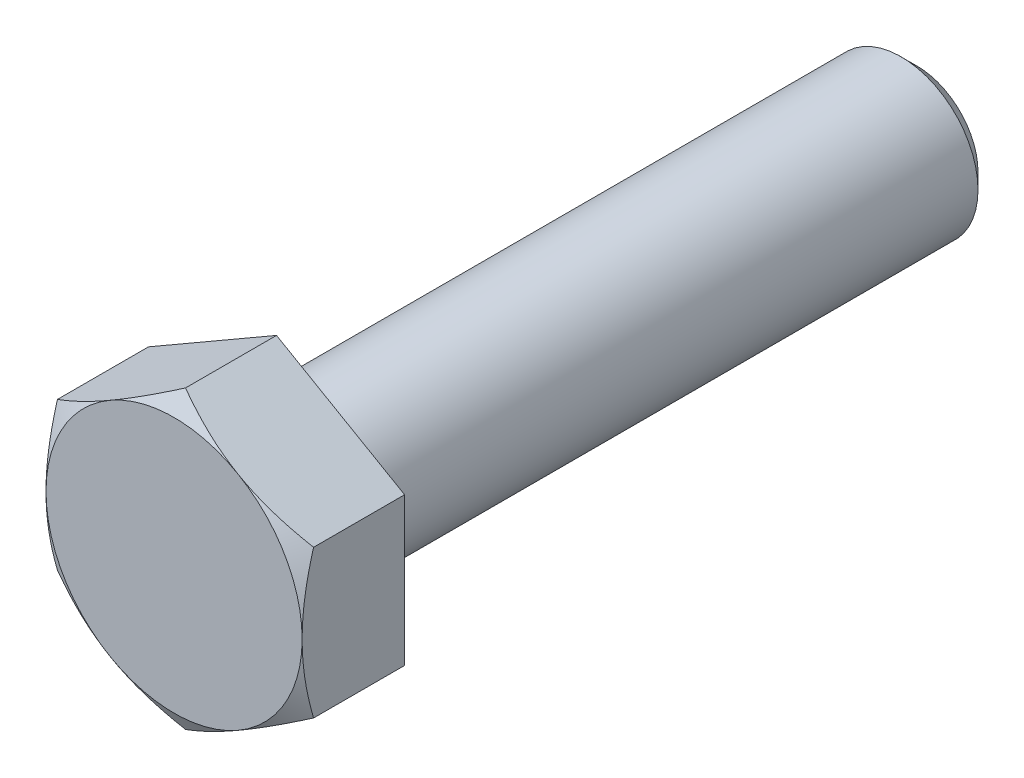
ISO-10303-21;
HEADER;
FILE_DESCRIPTION(('STEP AP214'),'2;1');
FILE_NAME('part.step','',(''),(''),'','','');
FILE_SCHEMA(('AUTOMOTIVE_DESIGN { 1 0 10303 214 1 1 1 1 }'));
ENDSEC;
DATA;
#1=APPLICATION_CONTEXT('core data for automotive mechanical design processes');
#2=APPLICATION_PROTOCOL_DEFINITION('international standard','automotive_design',2000,#1);
#3=PRODUCT_CONTEXT('',#1,'mechanical');
#4=PRODUCT('Part','Part','',(#3));
#5=PRODUCT_RELATED_PRODUCT_CATEGORY('part','',(#4));
#6=PRODUCT_DEFINITION_FORMATION('','',#4);
#7=PRODUCT_DEFINITION_CONTEXT('part definition',#1,'design');
#8=PRODUCT_DEFINITION('design','',#6,#7);
#9=PRODUCT_DEFINITION_SHAPE('','',#8);
#10=(LENGTH_UNIT() NAMED_UNIT(*) SI_UNIT(.MILLI.,.METRE.));
#11=(NAMED_UNIT(*) PLANE_ANGLE_UNIT() SI_UNIT($,.RADIAN.));
#12=(NAMED_UNIT(*) SI_UNIT($,.STERADIAN.) SOLID_ANGLE_UNIT());
#13=UNCERTAINTY_MEASURE_WITH_UNIT(LENGTH_MEASURE(1.E-05),#10,'distance_accuracy_value','');
#14=(GEOMETRIC_REPRESENTATION_CONTEXT(3) GLOBAL_UNCERTAINTY_ASSIGNED_CONTEXT((#13)) GLOBAL_UNIT_ASSIGNED_CONTEXT((#10,
#11,#12)) REPRESENTATION_CONTEXT('',''));
#15=CARTESIAN_POINT('',(0.,0.,0.));
#16=DIRECTION('',(0.,0.,1.));
#17=DIRECTION('',(1.,0.,0.));
#18=AXIS2_PLACEMENT_3D('',#15,#16,#17);
#19=CARTESIAN_POINT('',(25.5,22.5,-25.4));
#20=DIRECTION('',(0.,0.,-1.));
#21=DIRECTION('',(-1.,0.,0.));
#22=AXIS2_PLACEMENT_3D('',#19,#20,#21);
#23=PLANE('',#22);
#24=CARTESIAN_POINT('',(25.5,22.5,-25.4000000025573));
#25=DIRECTION('',(0.,0.,-1.));
#26=DIRECTION('',(0.,1.,0.));
#27=AXIS2_PLACEMENT_3D('',#24,#25,#26);
#28=CIRCLE('',#27,4.99999999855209);
#29=CARTESIAN_POINT('',(23.000000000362,18.1698729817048,-25.4000000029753));
#30=VERTEX_POINT('',#29);
#31=CARTESIAN_POINT('',(20.500000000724,22.5,-25.4000000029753));
#32=VERTEX_POINT('',#31);
#33=EDGE_CURVE('E19',#30,#32,#28,.T.);
#34=ORIENTED_EDGE('',*,*,#33,.F.);
#35=CARTESIAN_POINT('',(25.5,22.5,-25.4000000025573));
#36=DIRECTION('',(0.,0.,-1.));
#37=DIRECTION('',(0.,1.,0.));
#38=AXIS2_PLACEMENT_3D('',#35,#36,#37);
#39=CIRCLE('',#38,4.99999999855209);
#40=CARTESIAN_POINT('',(27.999999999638,18.1698729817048,-25.4000000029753));
#41=VERTEX_POINT('',#40);
#42=EDGE_CURVE('E77',#41,#30,#39,.T.);
#43=ORIENTED_EDGE('',*,*,#42,.F.);
#44=CARTESIAN_POINT('',(25.5,22.5,-25.4000000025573));
#45=DIRECTION('',(0.,0.,-1.));
#46=DIRECTION('',(0.,1.,0.));
#47=AXIS2_PLACEMENT_3D('',#44,#45,#46);
#48=CIRCLE('',#47,4.99999999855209);
#49=CARTESIAN_POINT('',(30.499999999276,22.5,-25.4000000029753));
#50=VERTEX_POINT('',#49);
#51=EDGE_CURVE('E94',#50,#41,#48,.T.);
#52=ORIENTED_EDGE('',*,*,#51,.F.);
#53=CARTESIAN_POINT('',(25.5,22.5,-25.4000000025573));
#54=DIRECTION('',(0.,0.,-1.));
#55=DIRECTION('',(0.,1.,0.));
#56=AXIS2_PLACEMENT_3D('',#53,#54,#55);
#57=CIRCLE('',#56,4.99999999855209);
#58=CARTESIAN_POINT('',(27.999999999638,26.8301270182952,-25.4000000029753));
#59=VERTEX_POINT('',#58);
#60=EDGE_CURVE('E460',#59,#50,#57,.T.);
#61=ORIENTED_EDGE('',*,*,#60,.F.);
#62=CARTESIAN_POINT('',(25.5,22.5,-25.4000000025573));
#63=DIRECTION('',(0.,0.,-1.));
#64=DIRECTION('',(0.,1.,0.));
#65=AXIS2_PLACEMENT_3D('',#62,#63,#64);
#66=CIRCLE('',#65,4.99999999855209);
#67=CARTESIAN_POINT('',(23.000000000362,26.8301270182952,-25.4000000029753));
#68=VERTEX_POINT('',#67);
#69=EDGE_CURVE('E457',#68,#59,#66,.T.);
#70=ORIENTED_EDGE('',*,*,#69,.F.);
#71=CARTESIAN_POINT('',(25.5,22.5,-25.4000000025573));
#72=DIRECTION('',(0.,0.,-1.));
#73=DIRECTION('',(0.,1.,0.));
#74=AXIS2_PLACEMENT_3D('',#71,#72,#73);
#75=CIRCLE('',#74,4.99999999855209);
#76=EDGE_CURVE('E80',#32,#68,#75,.T.);
#77=ORIENTED_EDGE('',*,*,#76,.F.);
#78=EDGE_LOOP('',(#34,#43,#52,#61,#70,#77));
#79=FACE_BOUND('',#78,.T.);
#80=ADVANCED_FACE('F16',(#79),#23,.F.);
#81=CARTESIAN_POINT('',(25.5,22.5,-25.8492614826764));
#82=DIRECTION('',(0.,0.,-1.));
#83=DIRECTION('',(0.,1.,0.));
#84=AXIS2_PLACEMENT_3D('',#81,#82,#83);
#85=CONICAL_SURFACE('',#84,5.7781437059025,1.04719755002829);
#86=ORIENTED_EDGE('',*,*,#33,.T.);
#87=CARTESIAN_POINT('',(20.4999999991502,19.6132486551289,-25.8465819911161));
#88=CARTESIAN_POINT('',(20.4999999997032,19.8482289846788,-25.7787319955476));
#89=CARTESIAN_POINT('',(20.4999999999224,20.085091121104,-25.7165695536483));
#90=CARTESIAN_POINT('',(20.5000000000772,20.5609033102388,-25.6069472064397));
#91=CARTESIAN_POINT('',(20.5000000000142,20.7998367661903,-25.5594146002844));
#92=CARTESIAN_POINT('',(20.4999999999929,21.16049190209,-25.501052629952));
#93=CARTESIAN_POINT('',(20.4999999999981,21.2811658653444,-25.4837477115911));
#94=CARTESIAN_POINT('',(20.5000000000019,21.5230915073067,-25.4537925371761));
#95=CARTESIAN_POINT('',(20.5000000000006,21.6443431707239,-25.4411421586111));
#96=CARTESIAN_POINT('',(20.4999999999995,21.8878727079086,-25.4207183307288));
#97=CARTESIAN_POINT('',(20.4999999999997,22.0101526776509,-25.4129696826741));
#98=CARTESIAN_POINT('',(20.5000000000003,22.2549531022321,-25.4025997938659));
#99=CARTESIAN_POINT('',(20.5000000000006,22.3774735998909,-25.399979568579));
#100=CARTESIAN_POINT('',(20.5,22.5000000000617,-25.4000000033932));
#101=B_SPLINE_CURVE_WITH_KNOTS('',3,(#87,#88,#89,#90,#91,#92,#93,#94,#95,#96,#97,#98,#99,#100),
.UNSPECIFIED.,.F.,.F.,(4,2,2,2,2,2,4),(0.,0.734036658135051,1.46436443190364,1.83000749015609,
2.19564092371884,2.56310985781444,2.93065154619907),.UNSPECIFIED.);
#102=CARTESIAN_POINT('',(20.5000000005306,19.6132486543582,-25.8465819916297));
#103=VERTEX_POINT('',#102);
#104=EDGE_CURVE('E99',#103,#32,#101,.T.);
#105=ORIENTED_EDGE('',*,*,#104,.F.);
#106=CARTESIAN_POINT('',(22.999999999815,18.1698729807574,-25.4000000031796));
#107=CARTESIAN_POINT('',(22.8938890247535,18.2311361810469,-25.3999795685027));
#108=CARTESIAN_POINT('',(22.787783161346,18.2923964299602,-25.4025997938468));
#109=CARTESIAN_POINT('',(22.5757797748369,18.4147966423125,-25.4129696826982));
#110=CARTESIAN_POINT('',(22.4698822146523,18.4759366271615,-25.4207183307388));
#111=CARTESIAN_POINT('',(22.2589794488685,18.5977013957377,-25.4411421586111));
#112=CARTESIAN_POINT('',(22.1539724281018,18.6583272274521,-25.4537925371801));
#113=CARTESIAN_POINT('',(21.9444586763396,18.7792900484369,-25.4837477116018));
#114=CARTESIAN_POINT('',(21.8399519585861,18.8396270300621,-25.5010526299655));
#115=CARTESIAN_POINT('',(21.5276154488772,19.019954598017,-25.5594146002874));
#116=CARTESIAN_POINT('',(21.3206930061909,19.1394213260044,-25.6069472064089));
#117=CARTESIAN_POINT('',(20.9086275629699,19.377327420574,-25.7165695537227));
#118=CARTESIAN_POINT('',(20.7034989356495,19.495758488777,-25.778731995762));
#119=CARTESIAN_POINT('',(20.5000000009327,19.6132486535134,-25.8465819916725));
#120=B_SPLINE_CURVE_WITH_KNOTS('',3,(#106,#107,#108,#109,#110,#111,#112,#113,#114,#115,#116,
#117,#118,#119),.UNSPECIFIED.,.F.,.F.,(4,2,2,2,2,2,4),(0.,0.367541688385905,0.735010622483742,
1.10064405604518,1.46628711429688,2.19661488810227,2.93065154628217),.UNSPECIFIED.);
#121=EDGE_CURVE('E96',#30,#103,#120,.T.);
#122=ORIENTED_EDGE('',*,*,#121,.F.);
#123=EDGE_LOOP('',(#86,#105,#122));
#124=FACE_BOUND('',#123,.T.);
#125=ADVANCED_FACE('F97',(#124),#85,.T.);
#126=CARTESIAN_POINT('',(25.5,22.5,-25.8492614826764));
#127=DIRECTION('',(0.,0.,-1.));
#128=DIRECTION('',(0.,1.,0.));
#129=AXIS2_PLACEMENT_3D('',#126,#127,#128);
#130=CONICAL_SURFACE('',#129,5.7781437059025,1.04719755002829);
#131=CARTESIAN_POINT('',(20.49999999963,22.5,-25.4000000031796));
#132=CARTESIAN_POINT('',(20.4999999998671,22.6225264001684,-25.3999795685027));
#133=CARTESIAN_POINT('',(20.4999999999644,22.7450468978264,-25.4025997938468));
#134=CARTESIAN_POINT('',(20.5000000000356,22.9898473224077,-25.4129696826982));
#135=CARTESIAN_POINT('',(20.5000000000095,23.1121272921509,-25.4207183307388));
#136=CARTESIAN_POINT('',(20.4999999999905,23.3556568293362,-25.4411421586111));
#137=CARTESIAN_POINT('',(20.4999999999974,23.476908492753,-25.4537925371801));
#138=CARTESIAN_POINT('',(20.5000000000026,23.7188341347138,-25.4837477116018));
#139=CARTESIAN_POINT('',(20.500000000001,23.839508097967,-25.5010526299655));
#140=CARTESIAN_POINT('',(20.4999999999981,24.2001632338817,-25.5594146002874));
#141=CARTESIAN_POINT('',(20.4999999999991,24.4390966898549,-25.6069472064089));
#142=CARTESIAN_POINT('',(20.500000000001,24.9149088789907,-25.7165695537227));
#143=CARTESIAN_POINT('',(20.5000000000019,25.1517710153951,-25.778731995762));
#144=CARTESIAN_POINT('',(20.5,25.3867513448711,-25.8465819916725));
#145=B_SPLINE_CURVE_WITH_KNOTS('',3,(#131,#132,#133,#134,#135,#136,#137,#138,#139,#140,#141,
#142,#143,#144),.UNSPECIFIED.,.F.,.F.,(4,2,2,2,2,2,4),(0.,0.367541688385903,0.73501062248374,
1.10064405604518,1.46628711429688,2.19661488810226,2.93065154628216),.UNSPECIFIED.);
#146=CARTESIAN_POINT('',(20.5000000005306,25.3867513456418,-25.8465819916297));
#147=VERTEX_POINT('',#146);
#148=EDGE_CURVE('E220',#32,#147,#145,.T.);
#149=ORIENTED_EDGE('',*,*,#148,.F.);
#150=ORIENTED_EDGE('',*,*,#76,.T.);
#151=CARTESIAN_POINT('',(20.5000000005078,25.3867513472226,-25.8465819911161));
#152=CARTESIAN_POINT('',(20.7034989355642,25.5042415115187,-25.7787319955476));
#153=CARTESIAN_POINT('',(20.9086275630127,25.6226725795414,-25.7165695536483));
#154=CARTESIAN_POINT('',(21.3206930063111,25.8605786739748,-25.6069472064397));
#155=CARTESIAN_POINT('',(21.5276154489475,25.9800454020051,-25.5594146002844));
#156=CARTESIAN_POINT('',(21.8399519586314,26.1603729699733,-25.501052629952));
#157=CARTESIAN_POINT('',(21.9444586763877,26.2207099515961,-25.4837477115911));
#158=CARTESIAN_POINT('',(22.1539724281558,26.3416727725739,-25.4537925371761));
#159=CARTESIAN_POINT('',(22.2589794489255,26.4022986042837,-25.4411421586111));
#160=CARTESIAN_POINT('',(22.4698822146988,26.524063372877,-25.4207183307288));
#161=CARTESIAN_POINT('',(22.5757797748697,26.5852033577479,-25.4129696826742));
#162=CARTESIAN_POINT('',(22.7877831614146,26.707603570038,-25.4025997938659));
#163=CARTESIAN_POINT('',(22.8938890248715,26.7688638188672,-25.399979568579));
#164=CARTESIAN_POINT('',(23.0000000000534,26.830127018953,-25.4000000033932));
#165=B_SPLINE_CURVE_WITH_KNOTS('',3,(#151,#152,#153,#154,#155,#156,#157,#158,#159,#160,#161,
#162,#163,#164),.UNSPECIFIED.,.F.,.F.,(4,2,2,2,2,2,4),(0.,0.734036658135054,1.46436443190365,
1.8300074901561,2.19564092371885,2.56310985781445,2.9306515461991),.UNSPECIFIED.);
#166=EDGE_CURVE('E210',#147,#68,#165,.T.);
#167=ORIENTED_EDGE('',*,*,#166,.F.);
#168=EDGE_LOOP('',(#149,#150,#167));
#169=FACE_BOUND('',#168,.T.);
#170=ADVANCED_FACE('F188',(#169),#130,.T.);
#171=CARTESIAN_POINT('',(25.5,22.5,-25.8492614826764));
#172=DIRECTION('',(0.,0.,-1.));
#173=DIRECTION('',(0.,1.,0.));
#174=AXIS2_PLACEMENT_3D('',#171,#172,#173);
#175=CONICAL_SURFACE('',#174,5.7781437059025,1.04719755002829);
#176=CARTESIAN_POINT('',(22.999999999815,26.8301270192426,-25.4000000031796));
#177=CARTESIAN_POINT('',(23.1061109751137,26.8913902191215,-25.3999795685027));
#178=CARTESIAN_POINT('',(23.2122168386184,26.9526504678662,-25.4025997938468));
#179=CARTESIAN_POINT('',(23.4242202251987,27.0750506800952,-25.4129696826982));
#180=CARTESIAN_POINT('',(23.5301177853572,27.1361906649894,-25.4207183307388));
#181=CARTESIAN_POINT('',(23.7410205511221,27.2579554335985,-25.4411421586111));
#182=CARTESIAN_POINT('',(23.8460275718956,27.318581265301,-25.4537925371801));
#183=CARTESIAN_POINT('',(24.055541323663,27.4395440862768,-25.4837477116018));
#184=CARTESIAN_POINT('',(24.1600480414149,27.4998810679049,-25.5010526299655));
#185=CARTESIAN_POINT('',(24.4723845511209,27.6802086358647,-25.5594146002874));
#186=CARTESIAN_POINT('',(24.6793069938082,27.7996753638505,-25.6069472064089));
#187=CARTESIAN_POINT('',(25.0913724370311,28.0375814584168,-25.7165695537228));
#188=CARTESIAN_POINT('',(25.2965010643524,28.1560125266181,-25.778731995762));
#189=CARTESIAN_POINT('',(25.4999999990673,28.2735026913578,-25.8465819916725));
#190=B_SPLINE_CURVE_WITH_KNOTS('',3,(#176,#177,#178,#179,#180,#181,#182,#183,#184,#185,#186,
#187,#188,#189),.UNSPECIFIED.,.F.,.F.,(4,2,2,2,2,2,4),(0.,0.367541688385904,0.73501062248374,
1.10064405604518,1.46628711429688,2.19661488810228,2.93065154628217),.UNSPECIFIED.);
#191=CARTESIAN_POINT('',(25.5,28.2735026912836,-25.8465819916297));
#192=VERTEX_POINT('',#191);
#193=EDGE_CURVE('E193',#68,#192,#190,.T.);
#194=ORIENTED_EDGE('',*,*,#193,.F.);
#195=ORIENTED_EDGE('',*,*,#69,.T.);
#196=CARTESIAN_POINT('',(25.5000000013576,28.2735026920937,-25.8465819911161));
#197=CARTESIAN_POINT('',(25.703498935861,28.1560125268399,-25.7787319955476));
#198=CARTESIAN_POINT('',(25.9086275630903,28.0375814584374,-25.7165695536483));
#199=CARTESIAN_POINT('',(26.3206930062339,27.799675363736,-25.6069472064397));
#200=CARTESIAN_POINT('',(26.5276154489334,27.6802086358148,-25.5594146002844));
#201=CARTESIAN_POINT('',(26.8399519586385,27.4998810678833,-25.501052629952));
#202=CARTESIAN_POINT('',(26.9444586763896,27.4395440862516,-25.4837477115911));
#203=CARTESIAN_POINT('',(27.1539724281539,27.3185812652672,-25.4537925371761));
#204=CARTESIAN_POINT('',(27.258979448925,27.2579554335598,-25.4411421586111));
#205=CARTESIAN_POINT('',(27.4698822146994,27.1361906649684,-25.4207183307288));
#206=CARTESIAN_POINT('',(27.57577977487,27.075050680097,-25.4129696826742));
#207=CARTESIAN_POINT('',(27.7877831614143,26.9526504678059,-25.4025997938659));
#208=CARTESIAN_POINT('',(27.893889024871,26.8913902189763,-25.399979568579));
#209=CARTESIAN_POINT('',(28.0000000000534,26.8301270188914,-25.4000000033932));
#210=B_SPLINE_CURVE_WITH_KNOTS('',3,(#196,#197,#198,#199,#200,#201,#202,#203,#204,#205,#206,
#207,#208,#209),.UNSPECIFIED.,.F.,.F.,(4,2,2,2,2,2,4),(0.,0.73403665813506,1.46436443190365,
1.8300074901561,2.19564092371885,2.56310985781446,2.93065154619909),.UNSPECIFIED.);
#211=EDGE_CURVE('E198',#192,#59,#210,.T.);
#212=ORIENTED_EDGE('',*,*,#211,.F.);
#213=EDGE_LOOP('',(#194,#195,#212));
#214=FACE_BOUND('',#213,.T.);
#215=ADVANCED_FACE('F182',(#214),#175,.T.);
#216=CARTESIAN_POINT('',(25.5,22.5,-25.8492614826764));
#217=DIRECTION('',(0.,0.,-1.));
#218=DIRECTION('',(0.,1.,0.));
#219=AXIS2_PLACEMENT_3D('',#216,#217,#218);
#220=CONICAL_SURFACE('',#219,5.7781437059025,1.04719755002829);
#221=CARTESIAN_POINT('',(28.000000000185,26.8301270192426,-25.4000000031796));
#222=CARTESIAN_POINT('',(28.1061109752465,26.7688638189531,-25.3999795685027));
#223=CARTESIAN_POINT('',(28.212216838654,26.7076035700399,-25.4025997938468));
#224=CARTESIAN_POINT('',(28.4242202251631,26.5852033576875,-25.4129696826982));
#225=CARTESIAN_POINT('',(28.5301177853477,26.5240633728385,-25.4207183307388));
#226=CARTESIAN_POINT('',(28.7410205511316,26.4022986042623,-25.4411421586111));
#227=CARTESIAN_POINT('',(28.8460275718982,26.3416727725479,-25.4537925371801));
#228=CARTESIAN_POINT('',(29.0555413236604,26.2207099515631,-25.4837477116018));
#229=CARTESIAN_POINT('',(29.160048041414,26.1603729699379,-25.5010526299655));
#230=CARTESIAN_POINT('',(29.4723845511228,25.980045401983,-25.5594146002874));
#231=CARTESIAN_POINT('',(29.6793069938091,25.8605786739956,-25.6069472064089));
#232=CARTESIAN_POINT('',(30.0913724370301,25.622672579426,-25.7165695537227));
#233=CARTESIAN_POINT('',(30.2965010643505,25.504241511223,-25.778731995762));
#234=CARTESIAN_POINT('',(30.4999999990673,25.3867513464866,-25.8465819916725));
#235=B_SPLINE_CURVE_WITH_KNOTS('',3,(#221,#222,#223,#224,#225,#226,#227,#228,#229,#230,#231,
#232,#233,#234),.UNSPECIFIED.,.F.,.F.,(4,2,2,2,2,2,4),(0.,0.367541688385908,0.735010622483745,
1.10064405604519,1.46628711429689,2.19661488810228,2.93065154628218),.UNSPECIFIED.);
#236=CARTESIAN_POINT('',(30.4999999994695,25.3867513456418,-25.8465819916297));
#237=VERTEX_POINT('',#236);
#238=EDGE_CURVE('E173',#59,#237,#235,.T.);
#239=ORIENTED_EDGE('',*,*,#238,.F.);
#240=ORIENTED_EDGE('',*,*,#60,.T.);
#241=CARTESIAN_POINT('',(30.5000000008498,25.3867513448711,-25.8465819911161));
#242=CARTESIAN_POINT('',(30.5000000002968,25.1517710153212,-25.7787319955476));
#243=CARTESIAN_POINT('',(30.5000000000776,24.914908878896,-25.7165695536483));
#244=CARTESIAN_POINT('',(30.4999999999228,24.4390966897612,-25.6069472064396));
#245=CARTESIAN_POINT('',(30.4999999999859,24.2001632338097,-25.5594146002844));
#246=CARTESIAN_POINT('',(30.5000000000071,23.83950809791,-25.501052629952));
#247=CARTESIAN_POINT('',(30.5000000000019,23.7188341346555,-25.4837477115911));
#248=CARTESIAN_POINT('',(30.4999999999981,23.4769084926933,-25.4537925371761));
#249=CARTESIAN_POINT('',(30.4999999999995,23.3556568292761,-25.4411421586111));
#250=CARTESIAN_POINT('',(30.5000000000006,23.1121272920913,-25.4207183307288));
#251=CARTESIAN_POINT('',(30.5000000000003,22.9898473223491,-25.4129696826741));
#252=CARTESIAN_POINT('',(30.4999999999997,22.7450468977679,-25.4025997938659));
#253=CARTESIAN_POINT('',(30.4999999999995,22.6225264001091,-25.399979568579));
#254=CARTESIAN_POINT('',(30.5,22.4999999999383,-25.4000000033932));
#255=B_SPLINE_CURVE_WITH_KNOTS('',3,(#241,#242,#243,#244,#245,#246,#247,#248,#249,#250,#251,
#252,#253,#254),.UNSPECIFIED.,.F.,.F.,(4,2,2,2,2,2,4),(0.,0.734036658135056,1.46436443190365,
1.83000749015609,2.19564092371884,2.56310985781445,2.93065154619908),.UNSPECIFIED.);
#256=EDGE_CURVE('E166',#237,#50,#255,.T.);
#257=ORIENTED_EDGE('',*,*,#256,.F.);
#258=EDGE_LOOP('',(#239,#240,#257));
#259=FACE_BOUND('',#258,.T.);
#260=ADVANCED_FACE('F178',(#259),#220,.T.);
#261=CARTESIAN_POINT('',(25.5,22.5,-25.8492614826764));
#262=DIRECTION('',(0.,0.,-1.));
#263=DIRECTION('',(0.,1.,0.));
#264=AXIS2_PLACEMENT_3D('',#261,#262,#263);
#265=CONICAL_SURFACE('',#264,5.7781437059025,1.04719755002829);
#266=CARTESIAN_POINT('',(30.50000000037,22.5,-25.4000000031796));
#267=CARTESIAN_POINT('',(30.5000000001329,22.3774735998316,-25.3999795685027));
#268=CARTESIAN_POINT('',(30.5000000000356,22.2549531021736,-25.4025997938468));
#269=CARTESIAN_POINT('',(30.4999999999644,22.0101526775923,-25.4129696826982));
#270=CARTESIAN_POINT('',(30.4999999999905,21.8878727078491,-25.4207183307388));
#271=CARTESIAN_POINT('',(30.5000000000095,21.6443431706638,-25.4411421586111));
#272=CARTESIAN_POINT('',(30.5000000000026,21.523091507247,-25.4537925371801));
#273=CARTESIAN_POINT('',(30.4999999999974,21.2811658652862,-25.4837477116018));
#274=CARTESIAN_POINT('',(30.4999999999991,21.160491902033,-25.5010526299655));
#275=CARTESIAN_POINT('',(30.5000000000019,20.7998367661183,-25.5594146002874));
#276=CARTESIAN_POINT('',(30.500000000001,20.5609033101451,-25.6069472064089));
#277=CARTESIAN_POINT('',(30.499999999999,20.0850911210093,-25.7165695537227));
#278=CARTESIAN_POINT('',(30.4999999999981,19.8482289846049,-25.778731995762));
#279=CARTESIAN_POINT('',(30.5,19.6132486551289,-25.8465819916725));
#280=B_SPLINE_CURVE_WITH_KNOTS('',3,(#266,#267,#268,#269,#270,#271,#272,#273,#274,#275,#276,
#277,#278,#279),.UNSPECIFIED.,.F.,.F.,(4,2,2,2,2,2,4),(0.,0.3675416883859,0.735010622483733,
1.10064405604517,1.46628711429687,2.19661488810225,2.93065154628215),.UNSPECIFIED.);
#281=CARTESIAN_POINT('',(30.4999999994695,19.6132486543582,-25.8465819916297));
#282=VERTEX_POINT('',#281);
#283=EDGE_CURVE('E161',#50,#282,#280,.T.);
#284=ORIENTED_EDGE('',*,*,#283,.F.);
#285=ORIENTED_EDGE('',*,*,#51,.T.);
#286=CARTESIAN_POINT('',(30.4999999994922,19.6132486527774,-25.8465819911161));
#287=CARTESIAN_POINT('',(30.2965010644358,19.4957584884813,-25.7787319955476));
#288=CARTESIAN_POINT('',(30.0913724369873,19.3773274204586,-25.7165695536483));
#289=CARTESIAN_POINT('',(29.6793069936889,19.1394213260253,-25.6069472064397));
#290=CARTESIAN_POINT('',(29.4723845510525,19.0199545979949,-25.5594146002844));
#291=CARTESIAN_POINT('',(29.1600480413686,18.8396270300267,-25.501052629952));
#292=CARTESIAN_POINT('',(29.0555413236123,18.7792900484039,-25.4837477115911));
#293=CARTESIAN_POINT('',(28.8460275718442,18.6583272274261,-25.4537925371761));
#294=CARTESIAN_POINT('',(28.7410205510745,18.5977013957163,-25.4411421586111));
#295=CARTESIAN_POINT('',(28.5301177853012,18.475936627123,-25.4207183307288));
#296=CARTESIAN_POINT('',(28.4242202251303,18.4147966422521,-25.4129696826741));
#297=CARTESIAN_POINT('',(28.2122168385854,18.292396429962,-25.4025997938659));
#298=CARTESIAN_POINT('',(28.1061109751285,18.2311361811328,-25.399979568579));
#299=CARTESIAN_POINT('',(27.9999999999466,18.169872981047,-25.4000000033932));
#300=B_SPLINE_CURVE_WITH_KNOTS('',3,(#286,#287,#288,#289,#290,#291,#292,#293,#294,#295,#296,
#297,#298,#299),.UNSPECIFIED.,.F.,.F.,(4,2,2,2,2,2,4),(0.,0.734036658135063,1.46436443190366,
1.83000749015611,2.19564092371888,2.56310985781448,2.93065154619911),.UNSPECIFIED.);
#301=EDGE_CURVE('E137',#282,#41,#300,.T.);
#302=ORIENTED_EDGE('',*,*,#301,.F.);
#303=EDGE_LOOP('',(#284,#285,#302));
#304=FACE_BOUND('',#303,.T.);
#305=ADVANCED_FACE('F125',(#304),#265,.T.);
#306=CARTESIAN_POINT('',(25.5,22.5,-25.8492614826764));
#307=DIRECTION('',(0.,0.,-1.));
#308=DIRECTION('',(0.,1.,0.));
#309=AXIS2_PLACEMENT_3D('',#306,#307,#308);
#310=CONICAL_SURFACE('',#309,5.7781437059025,1.04719755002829);
#311=CARTESIAN_POINT('',(28.000000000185,18.1698729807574,-25.4000000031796));
#312=CARTESIAN_POINT('',(27.8938890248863,18.1086097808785,-25.3999795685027));
#313=CARTESIAN_POINT('',(27.7877831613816,18.0473495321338,-25.4025997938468));
#314=CARTESIAN_POINT('',(27.5757797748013,17.9249493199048,-25.4129696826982));
#315=CARTESIAN_POINT('',(27.4698822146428,17.8638093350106,-25.4207183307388));
#316=CARTESIAN_POINT('',(27.2589794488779,17.7420445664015,-25.4411421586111));
#317=CARTESIAN_POINT('',(27.1539724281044,17.681418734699,-25.4537925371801));
#318=CARTESIAN_POINT('',(26.944458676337,17.5604559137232,-25.4837477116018));
#319=CARTESIAN_POINT('',(26.8399519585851,17.5001189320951,-25.5010526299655));
#320=CARTESIAN_POINT('',(26.5276154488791,17.3197913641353,-25.5594146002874));
#321=CARTESIAN_POINT('',(26.3206930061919,17.2003246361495,-25.6069472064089));
#322=CARTESIAN_POINT('',(25.9086275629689,16.9624185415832,-25.7165695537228));
#323=CARTESIAN_POINT('',(25.7034989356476,16.8439874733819,-25.778731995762));
#324=CARTESIAN_POINT('',(25.5000000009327,16.7264973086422,-25.8465819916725));
#325=B_SPLINE_CURVE_WITH_KNOTS('',3,(#311,#312,#313,#314,#315,#316,#317,#318,#319,#320,#321,
#322,#323,#324),.UNSPECIFIED.,.F.,.F.,(4,2,2,2,2,2,4),(0.,0.367541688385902,0.735010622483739,
1.10064405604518,1.46628711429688,2.19661488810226,2.93065154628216),.UNSPECIFIED.);
#326=CARTESIAN_POINT('',(25.4999999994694,16.72649730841,-25.8465819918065));
#327=VERTEX_POINT('',#326);
#328=EDGE_CURVE('E92',#41,#327,#325,.T.);
#329=ORIENTED_EDGE('',*,*,#328,.F.);
#330=ORIENTED_EDGE('',*,*,#42,.T.);
#331=CARTESIAN_POINT('',(25.4999999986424,16.7264973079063,-25.8465819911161));
#332=CARTESIAN_POINT('',(25.296501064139,16.8439874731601,-25.7787319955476));
#333=CARTESIAN_POINT('',(25.0913724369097,16.9624185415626,-25.7165695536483));
#334=CARTESIAN_POINT('',(24.6793069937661,17.200324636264,-25.6069472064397));
#335=CARTESIAN_POINT('',(24.4723845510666,17.3197913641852,-25.5594146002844));
#336=CARTESIAN_POINT('',(24.1600480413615,17.5001189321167,-25.501052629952));
#337=CARTESIAN_POINT('',(24.0555413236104,17.5604559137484,-25.4837477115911));
#338=CARTESIAN_POINT('',(23.8460275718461,17.6814187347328,-25.4537925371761));
#339=CARTESIAN_POINT('',(23.741020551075,17.7420445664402,-25.4411421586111));
#340=CARTESIAN_POINT('',(23.5301177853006,17.8638093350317,-25.4207183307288));
#341=CARTESIAN_POINT('',(23.42422022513,17.924949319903,-25.4129696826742));
#342=CARTESIAN_POINT('',(23.2122168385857,18.0473495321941,-25.4025997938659));
#343=CARTESIAN_POINT('',(23.106110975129,18.1086097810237,-25.399979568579));
#344=CARTESIAN_POINT('',(22.9999999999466,18.1698729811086,-25.4000000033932));
#345=B_SPLINE_CURVE_WITH_KNOTS('',3,(#331,#332,#333,#334,#335,#336,#337,#338,#339,#340,#341,
#342,#343,#344),.UNSPECIFIED.,.F.,.F.,(4,2,2,2,2,2,4),(0.,0.734036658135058,1.46436443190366,
1.8300074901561,2.19564092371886,2.56310985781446,2.9306515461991),.UNSPECIFIED.);
#346=EDGE_CURVE('E89',#327,#30,#345,.T.);
#347=ORIENTED_EDGE('',*,*,#346,.F.);
#348=EDGE_LOOP('',(#329,#330,#347));
#349=FACE_BOUND('',#348,.T.);
#350=ADVANCED_FACE('F87',(#349),#310,.T.);
#351=CARTESIAN_POINT('',(23.,18.1698729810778,-27.4));
#352=DIRECTION('',(-0.500000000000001,-0.866025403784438,0.));
#353=DIRECTION('',(0.866025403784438,-0.500000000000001,0.));
#354=AXIS2_PLACEMENT_3D('',#351,#352,#353);
#355=PLANE('',#354);
#356=DIRECTION('',(0.,0.,1.));
#357=VECTOR('',#356,1.);
#358=CARTESIAN_POINT('',(20.5,19.6132486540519,-27.4));
#359=LINE('',#358,#357);
#360=CARTESIAN_POINT('',(20.5,19.6132486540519,-29.4));
#361=VERTEX_POINT('',#360);
#362=EDGE_CURVE('E103',#361,#103,#359,.T.);
#363=ORIENTED_EDGE('',*,*,#362,.F.);
#364=DIRECTION('',(-0.866025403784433,0.500000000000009,0.));
#365=VECTOR('',#364,1.);
#366=CARTESIAN_POINT('',(25.5,16.7264973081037,-29.4));
#367=LINE('',#366,#365);
#368=CARTESIAN_POINT('',(25.5,16.7264973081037,-29.4));
#369=VERTEX_POINT('',#368);
#370=EDGE_CURVE('E136',#369,#361,#367,.T.);
#371=ORIENTED_EDGE('',*,*,#370,.F.);
#372=DIRECTION('',(0.,0.,1.));
#373=VECTOR('',#372,1.);
#374=CARTESIAN_POINT('',(25.5,16.7264973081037,-27.4));
#375=LINE('',#374,#373);
#376=EDGE_CURVE('E108',#327,#369,#375,.F.);
#377=ORIENTED_EDGE('',*,*,#376,.F.);
#378=ORIENTED_EDGE('',*,*,#346,.T.);
#379=ORIENTED_EDGE('',*,*,#121,.T.);
#380=EDGE_LOOP('',(#363,#371,#377,#378,#379));
#381=FACE_BOUND('',#380,.T.);
#382=ADVANCED_FACE('F105',(#381),#355,.T.);
#383=CARTESIAN_POINT('',(20.5,22.5,-27.4));
#384=DIRECTION('',(-1.,0.,0.));
#385=DIRECTION('',(0.,0.,1.));
#386=AXIS2_PLACEMENT_3D('',#383,#384,#385);
#387=PLANE('',#386);
#388=DIRECTION('',(0.,0.,1.));
#389=VECTOR('',#388,1.);
#390=CARTESIAN_POINT('',(20.5,25.3867513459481,-27.4));
#391=LINE('',#390,#389);
#392=CARTESIAN_POINT('',(20.5,25.3867513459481,-29.4));
#393=VERTEX_POINT('',#392);
#394=EDGE_CURVE('E217',#393,#147,#391,.T.);
#395=ORIENTED_EDGE('',*,*,#394,.F.);
#396=DIRECTION('',(0.,1.,0.));
#397=VECTOR('',#396,1.);
#398=CARTESIAN_POINT('',(20.5,22.5,-29.4));
#399=LINE('',#398,#397);
#400=EDGE_CURVE('E241',#361,#393,#399,.T.);
#401=ORIENTED_EDGE('',*,*,#400,.F.);
#402=ORIENTED_EDGE('',*,*,#362,.T.);
#403=ORIENTED_EDGE('',*,*,#104,.T.);
#404=ORIENTED_EDGE('',*,*,#148,.T.);
#405=EDGE_LOOP('',(#395,#401,#402,#403,#404));
#406=FACE_BOUND('',#405,.T.);
#407=ADVANCED_FACE('F263',(#406),#387,.T.);
#408=CARTESIAN_POINT('',(23.,26.8301270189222,-27.4));
#409=DIRECTION('',(-0.500000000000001,0.866025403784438,0.));
#410=DIRECTION('',(-0.866025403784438,-0.500000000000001,0.));
#411=AXIS2_PLACEMENT_3D('',#408,#409,#410);
#412=PLANE('',#411);
#413=ORIENTED_EDGE('',*,*,#166,.T.);
#414=ORIENTED_EDGE('',*,*,#193,.T.);
#415=DIRECTION('',(0.,0.,1.));
#416=VECTOR('',#415,1.);
#417=CARTESIAN_POINT('',(25.5,28.2735026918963,-27.4));
#418=LINE('',#417,#416);
#419=CARTESIAN_POINT('',(25.5,28.2735026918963,-29.4));
#420=VERTEX_POINT('',#419);
#421=EDGE_CURVE('E203',#420,#192,#418,.T.);
#422=ORIENTED_EDGE('',*,*,#421,.F.);
#423=DIRECTION('',(0.866025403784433,0.500000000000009,0.));
#424=VECTOR('',#423,1.);
#425=CARTESIAN_POINT('',(20.5,25.3867513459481,-29.4));
#426=LINE('',#425,#424);
#427=EDGE_CURVE('E246',#393,#420,#426,.T.);
#428=ORIENTED_EDGE('',*,*,#427,.F.);
#429=ORIENTED_EDGE('',*,*,#394,.T.);
#430=EDGE_LOOP('',(#413,#414,#422,#428,#429));
#431=FACE_BOUND('',#430,.T.);
#432=ADVANCED_FACE('F273',(#431),#412,.T.);
#433=CARTESIAN_POINT('',(28.,26.8301270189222,-27.4));
#434=DIRECTION('',(0.500000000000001,0.866025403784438,0.));
#435=DIRECTION('',(-0.866025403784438,0.500000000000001,0.));
#436=AXIS2_PLACEMENT_3D('',#433,#434,#435);
#437=PLANE('',#436);
#438=ORIENTED_EDGE('',*,*,#211,.T.);
#439=ORIENTED_EDGE('',*,*,#238,.T.);
#440=DIRECTION('',(0.,0.,-1.));
#441=VECTOR('',#440,1.);
#442=CARTESIAN_POINT('',(30.5,25.3867513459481,-27.4));
#443=LINE('',#442,#441);
#444=CARTESIAN_POINT('',(30.5,25.3867513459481,-29.4));
#445=VERTEX_POINT('',#444);
#446=EDGE_CURVE('E172',#445,#237,#443,.F.);
#447=ORIENTED_EDGE('',*,*,#446,.F.);
#448=DIRECTION('',(0.866025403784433,-0.500000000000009,0.));
#449=VECTOR('',#448,1.);
#450=CARTESIAN_POINT('',(25.5,28.2735026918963,-29.4));
#451=LINE('',#450,#449);
#452=EDGE_CURVE('E236',#420,#445,#451,.T.);
#453=ORIENTED_EDGE('',*,*,#452,.F.);
#454=ORIENTED_EDGE('',*,*,#421,.T.);
#455=EDGE_LOOP('',(#438,#439,#447,#453,#454));
#456=FACE_BOUND('',#455,.T.);
#457=ADVANCED_FACE('F156',(#456),#437,.T.);
#458=CARTESIAN_POINT('',(30.5,22.5,-27.4));
#459=DIRECTION('',(1.,0.,0.));
#460=DIRECTION('',(0.,0.,-1.));
#461=AXIS2_PLACEMENT_3D('',#458,#459,#460);
#462=PLANE('',#461);
#463=ORIENTED_EDGE('',*,*,#256,.T.);
#464=ORIENTED_EDGE('',*,*,#283,.T.);
#465=DIRECTION('',(0.,0.,1.));
#466=VECTOR('',#465,1.);
#467=CARTESIAN_POINT('',(30.5,19.6132486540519,-27.4));
#468=LINE('',#467,#466);
#469=CARTESIAN_POINT('',(30.5,19.6132486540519,-29.4));
#470=VERTEX_POINT('',#469);
#471=EDGE_CURVE('E282',#470,#282,#468,.T.);
#472=ORIENTED_EDGE('',*,*,#471,.F.);
#473=DIRECTION('',(0.,1.,0.));
#474=VECTOR('',#473,1.);
#475=CARTESIAN_POINT('',(30.5,22.5,-29.4));
#476=LINE('',#475,#474);
#477=EDGE_CURVE('E230',#445,#470,#476,.F.);
#478=ORIENTED_EDGE('',*,*,#477,.F.);
#479=ORIENTED_EDGE('',*,*,#446,.T.);
#480=EDGE_LOOP('',(#463,#464,#472,#478,#479));
#481=FACE_BOUND('',#480,.T.);
#482=ADVANCED_FACE('F149',(#481),#462,.T.);
#483=CARTESIAN_POINT('',(28.,18.1698729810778,-27.4));
#484=DIRECTION('',(0.500000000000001,-0.866025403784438,0.));
#485=DIRECTION('',(0.866025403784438,0.500000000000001,0.));
#486=AXIS2_PLACEMENT_3D('',#483,#484,#485);
#487=PLANE('',#486);
#488=ORIENTED_EDGE('',*,*,#301,.T.);
#489=ORIENTED_EDGE('',*,*,#328,.T.);
#490=ORIENTED_EDGE('',*,*,#376,.T.);
#491=DIRECTION('',(-0.866025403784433,-0.50000000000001,0.));
#492=VECTOR('',#491,1.);
#493=CARTESIAN_POINT('',(30.5,19.6132486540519,-29.4));
#494=LINE('',#493,#492);
#495=EDGE_CURVE('E226',#470,#369,#494,.T.);
#496=ORIENTED_EDGE('',*,*,#495,.F.);
#497=ORIENTED_EDGE('',*,*,#471,.T.);
#498=EDGE_LOOP('',(#488,#489,#490,#496,#497));
#499=FACE_BOUND('',#498,.T.);
#500=ADVANCED_FACE('F143',(#499),#487,.T.);
#501=CARTESIAN_POINT('',(25.5,22.5,-54.4));
#502=DIRECTION('',(0.,0.,1.));
#503=DIRECTION('',(1.,0.,0.));
#504=AXIS2_PLACEMENT_3D('',#501,#502,#503);
#505=PLANE('',#504);
#506=CARTESIAN_POINT('',(25.5,22.5,-54.3999999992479));
#507=DIRECTION('',(0.,0.,1.));
#508=DIRECTION('',(1.,0.,0.));
#509=AXIS2_PLACEMENT_3D('',#506,#507,#508);
#510=CIRCLE('',#509,2.38649999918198);
#511=CARTESIAN_POINT('',(27.886499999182,22.5,-54.3999999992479));
#512=VERTEX_POINT('',#511);
#513=EDGE_CURVE('E33',#512,#512,#510,.T.);
#514=ORIENTED_EDGE('',*,*,#513,.F.);
#515=EDGE_LOOP('',(#514));
#516=FACE_BOUND('',#515,.T.);
#517=ADVANCED_FACE('F148',(#516),#505,.F.);
#518=CARTESIAN_POINT('',(25.5,22.5,-29.4));
#519=DIRECTION('',(0.,0.,-1.));
#520=DIRECTION('',(-1.,0.,0.));
#521=AXIS2_PLACEMENT_3D('',#518,#519,#520);
#522=PLANE('',#521);
#523=CARTESIAN_POINT('',(25.5,22.5,-29.4));
#524=DIRECTION('',(0.,0.,-1.));
#525=DIRECTION('',(1.,0.,0.));
#526=AXIS2_PLACEMENT_3D('',#523,#524,#525);
#527=CIRCLE('',#526,3.25);
#528=CARTESIAN_POINT('',(28.75,22.5,-29.4));
#529=VERTEX_POINT('',#528);
#530=EDGE_CURVE('E319',#529,#529,#527,.F.);
#531=ORIENTED_EDGE('',*,*,#530,.T.);
#532=EDGE_LOOP('',(#531));
#533=FACE_BOUND('',#532,.T.);
#534=ORIENTED_EDGE('',*,*,#477,.T.);
#535=ORIENTED_EDGE('',*,*,#495,.T.);
#536=ORIENTED_EDGE('',*,*,#370,.T.);
#537=ORIENTED_EDGE('',*,*,#400,.T.);
#538=ORIENTED_EDGE('',*,*,#427,.T.);
#539=ORIENTED_EDGE('',*,*,#452,.T.);
#540=EDGE_LOOP('',(#534,#535,#536,#537,#538,#539));
#541=FACE_BOUND('',#540,.T.);
#542=ADVANCED_FACE('F258',(#533,#541),#522,.T.);
#543=CARTESIAN_POINT('',(25.5,22.5,-53.7864999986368));
#544=DIRECTION('',(0.,0.,1.));
#545=DIRECTION('',(1.,0.,0.));
#546=AXIS2_PLACEMENT_3D('',#543,#544,#545);
#547=CONICAL_SURFACE('',#546,2.99999999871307,0.785398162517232);
#548=CARTESIAN_POINT('',(25.5,22.5,-53.7865));
#549=DIRECTION('',(0.,0.,1.));
#550=DIRECTION('',(1.,0.,0.));
#551=AXIS2_PLACEMENT_3D('',#548,#549,#550);
#552=CIRCLE('',#551,3.);
#553=CARTESIAN_POINT('',(28.4999999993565,22.5,-53.7864999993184));
#554=VERTEX_POINT('',#553);
#555=EDGE_CURVE('E26',#554,#554,#552,.T.);
#556=ORIENTED_EDGE('',*,*,#555,.F.);
#557=EDGE_LOOP('',(#556));
#558=FACE_BOUND('',#557,.T.);
#559=ORIENTED_EDGE('',*,*,#513,.T.);
#560=EDGE_LOOP('',(#559));
#561=FACE_BOUND('',#560,.T.);
#562=ADVANCED_FACE('F311',(#558,#561),#547,.T.);
#563=CARTESIAN_POINT('',(25.5,22.5,-29.65));
#564=DIRECTION('',(0.,0.,-1.));
#565=DIRECTION('',(-1.,0.,0.));
#566=AXIS2_PLACEMENT_3D('',#563,#564,#565);
#567=TOROIDAL_SURFACE('',#566,3.25,0.25);
#568=ORIENTED_EDGE('',*,*,#530,.F.);
#569=EDGE_LOOP('',(#568));
#570=FACE_BOUND('',#569,.T.);
#571=CARTESIAN_POINT('',(25.5,22.5,-29.65));
#572=DIRECTION('',(0.,0.,1.));
#573=DIRECTION('',(1.,0.,0.));
#574=AXIS2_PLACEMENT_3D('',#571,#572,#573);
#575=CIRCLE('',#574,3.);
#576=CARTESIAN_POINT('',(28.5,22.5,-29.65));
#577=VERTEX_POINT('',#576);
#578=EDGE_CURVE('E11',#577,#577,#575,.F.);
#579=ORIENTED_EDGE('',*,*,#578,.F.);
#580=EDGE_LOOP('',(#579));
#581=FACE_BOUND('',#580,.T.);
#582=ADVANCED_FACE('F299',(#570,#581),#567,.F.);
#583=CARTESIAN_POINT('',(25.5,22.5,-41.59325));
#584=DIRECTION('',(0.,0.,1.));
#585=DIRECTION('',(1.,0.,0.));
#586=AXIS2_PLACEMENT_3D('',#583,#584,#585);
#587=CYLINDRICAL_SURFACE('',#586,3.);
#588=ORIENTED_EDGE('',*,*,#578,.T.);
#589=EDGE_LOOP('',(#588));
#590=FACE_BOUND('',#589,.T.);
#591=ORIENTED_EDGE('',*,*,#555,.T.);
#592=EDGE_LOOP('',(#591));
#593=FACE_BOUND('',#592,.T.);
#594=ADVANCED_FACE('F310',(#590,#593),#587,.T.);
#595=CLOSED_SHELL('',(#80,#125,#170,#215,#260,#305,#350,#382,#407,#432,#457,#482,#500,#517,#542,
#562,#582,#594));
#596=MANIFOLD_SOLID_BREP('B1',#595);
#597=ADVANCED_BREP_SHAPE_REPRESENTATION('',(#18,#596),#14);
#598=SHAPE_DEFINITION_REPRESENTATION(#9,#597);
ENDSEC;
END-ISO-10303-21;
